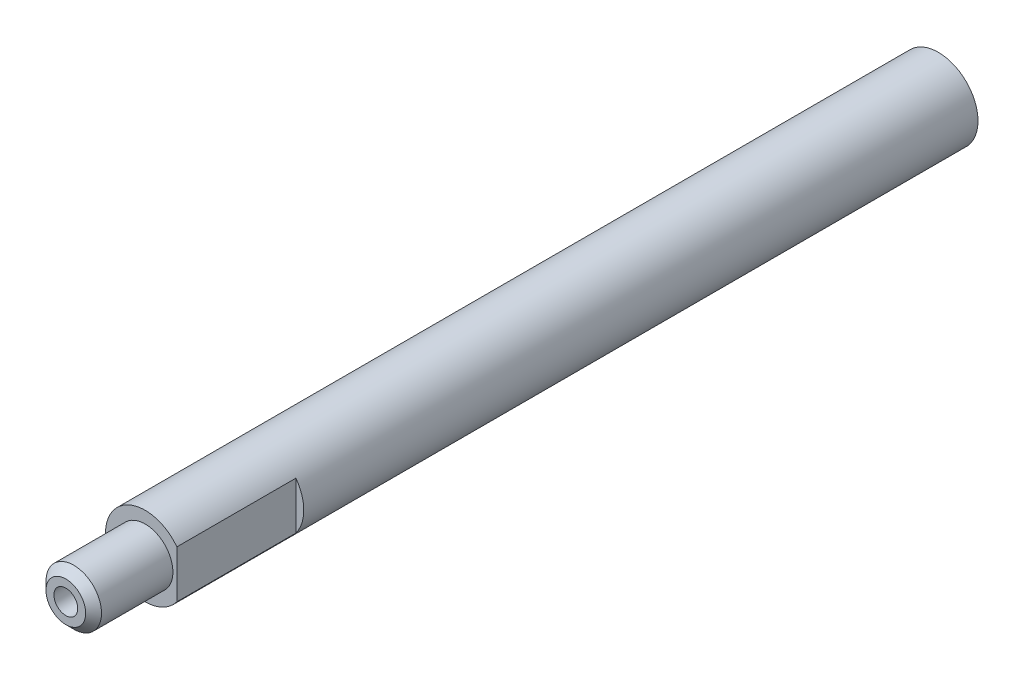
ISO-10303-21;
HEADER;
FILE_DESCRIPTION(('STEP AP214'),'2;1');
FILE_NAME('part.step','',(''),(''),'','','');
FILE_SCHEMA(('AUTOMOTIVE_DESIGN { 1 0 10303 214 1 1 1 1 }'));
ENDSEC;
DATA;
#1=APPLICATION_CONTEXT('core data for automotive mechanical design processes');
#2=APPLICATION_PROTOCOL_DEFINITION('international standard','automotive_design',2000,#1);
#3=PRODUCT_CONTEXT('',#1,'mechanical');
#4=PRODUCT('Part','Part','',(#3));
#5=PRODUCT_RELATED_PRODUCT_CATEGORY('part','',(#4));
#6=PRODUCT_DEFINITION_FORMATION('','',#4);
#7=PRODUCT_DEFINITION_CONTEXT('part definition',#1,'design');
#8=PRODUCT_DEFINITION('design','',#6,#7);
#9=PRODUCT_DEFINITION_SHAPE('','',#8);
#10=(LENGTH_UNIT() NAMED_UNIT(*) SI_UNIT(.MILLI.,.METRE.));
#11=(NAMED_UNIT(*) PLANE_ANGLE_UNIT() SI_UNIT($,.RADIAN.));
#12=(NAMED_UNIT(*) SI_UNIT($,.STERADIAN.) SOLID_ANGLE_UNIT());
#13=UNCERTAINTY_MEASURE_WITH_UNIT(LENGTH_MEASURE(1.E-05),#10,'distance_accuracy_value','');
#14=(GEOMETRIC_REPRESENTATION_CONTEXT(3) GLOBAL_UNCERTAINTY_ASSIGNED_CONTEXT((#13)) GLOBAL_UNIT_ASSIGNED_CONTEXT((#10,
#11,#12)) REPRESENTATION_CONTEXT('',''));
#15=CARTESIAN_POINT('',(0.,0.,0.));
#16=DIRECTION('',(0.,0.,1.));
#17=DIRECTION('',(1.,0.,0.));
#18=AXIS2_PLACEMENT_3D('',#15,#16,#17);
#19=CARTESIAN_POINT('',(0.,0.,110.));
#20=DIRECTION('',(0.,0.,-1.));
#21=DIRECTION('',(-1.,0.,0.));
#22=AXIS2_PLACEMENT_3D('',#19,#20,#21);
#23=CYLINDRICAL_SURFACE('',#22,5.);
#24=CARTESIAN_POINT('',(0.,0.,100.));
#25=DIRECTION('',(0.,0.,1.));
#26=DIRECTION('',(1.,0.,0.));
#27=AXIS2_PLACEMENT_3D('',#24,#25,#26);
#28=CIRCLE('',#27,5.);
#29=CARTESIAN_POINT('',(4.,3.,100.));
#30=VERTEX_POINT('',#29);
#31=CARTESIAN_POINT('',(4.,-3.,100.));
#32=VERTEX_POINT('',#31);
#33=EDGE_CURVE('E104',#30,#32,#28,.T.);
#34=ORIENTED_EDGE('',*,*,#33,.F.);
#35=DIRECTION('',(0.,0.,1.));
#36=VECTOR('',#35,1.);
#37=CARTESIAN_POINT('',(4.,3.,85.));
#38=LINE('',#37,#36);
#39=CARTESIAN_POINT('',(4.,3.,85.));
#40=VERTEX_POINT('',#39);
#41=EDGE_CURVE('E53',#40,#30,#38,.T.);
#42=ORIENTED_EDGE('',*,*,#41,.F.);
#43=CARTESIAN_POINT('',(0.,0.,85.));
#44=DIRECTION('',(0.,0.,1.));
#45=DIRECTION('',(1.,0.,0.));
#46=AXIS2_PLACEMENT_3D('',#43,#44,#45);
#47=CIRCLE('',#46,5.);
#48=CARTESIAN_POINT('',(4.,-3.,85.));
#49=VERTEX_POINT('',#48);
#50=EDGE_CURVE('E82',#49,#40,#47,.T.);
#51=ORIENTED_EDGE('',*,*,#50,.F.);
#52=DIRECTION('',(0.,0.,1.));
#53=VECTOR('',#52,1.);
#54=CARTESIAN_POINT('',(4.,-3.,85.));
#55=LINE('',#54,#53);
#56=EDGE_CURVE('E91',#49,#32,#55,.T.);
#57=ORIENTED_EDGE('',*,*,#56,.T.);
#58=EDGE_LOOP('',(#34,#42,#51,#57));
#59=FACE_BOUND('',#58,.T.);
#60=CARTESIAN_POINT('',(0.,0.,0.));
#61=DIRECTION('',(0.,0.,1.));
#62=DIRECTION('',(1.,0.,0.));
#63=AXIS2_PLACEMENT_3D('',#60,#61,#62);
#64=CIRCLE('',#63,5.);
#65=CARTESIAN_POINT('',(5.,0.,0.));
#66=VERTEX_POINT('',#65);
#67=EDGE_CURVE('E105',#66,#66,#64,.T.);
#68=ORIENTED_EDGE('',*,*,#67,.T.);
#69=EDGE_LOOP('',(#68));
#70=FACE_BOUND('',#69,.T.);
#71=ADVANCED_FACE('F38',(#59,#70),#23,.T.);
#72=CARTESIAN_POINT('',(0.,0.,0.));
#73=DIRECTION('',(0.,0.,1.));
#74=DIRECTION('',(1.,0.,0.));
#75=AXIS2_PLACEMENT_3D('',#72,#73,#74);
#76=PLANE('',#75);
#77=CARTESIAN_POINT('',(0.,0.,0.));
#78=DIRECTION('',(0.,0.,-1.));
#79=DIRECTION('',(-1.,0.,0.));
#80=AXIS2_PLACEMENT_3D('',#77,#78,#79);
#81=CIRCLE('',#80,2.);
#82=CARTESIAN_POINT('',(-2.,0.,0.));
#83=VERTEX_POINT('',#82);
#84=EDGE_CURVE('E80',#83,#83,#81,.T.);
#85=ORIENTED_EDGE('',*,*,#84,.F.);
#86=EDGE_LOOP('',(#85));
#87=FACE_BOUND('',#86,.T.);
#88=ORIENTED_EDGE('',*,*,#67,.F.);
#89=EDGE_LOOP('',(#88));
#90=FACE_BOUND('',#89,.T.);
#91=ADVANCED_FACE('F129',(#87,#90),#76,.F.);
#92=CARTESIAN_POINT('',(0.,0.,100.));
#93=DIRECTION('',(0.,0.,1.));
#94=DIRECTION('',(1.,0.,0.));
#95=AXIS2_PLACEMENT_3D('',#92,#93,#94);
#96=PLANE('',#95);
#97=DIRECTION('',(0.,-1.,0.));
#98=VECTOR('',#97,1.);
#99=CARTESIAN_POINT('',(4.,3.,100.));
#100=LINE('',#99,#98);
#101=EDGE_CURVE('E79',#30,#32,#100,.T.);
#102=ORIENTED_EDGE('',*,*,#101,.F.);
#103=ORIENTED_EDGE('',*,*,#33,.T.);
#104=EDGE_LOOP('',(#102,#103));
#105=FACE_BOUND('',#104,.T.);
#106=CARTESIAN_POINT('',(0.,0.,100.));
#107=DIRECTION('',(0.,0.,1.));
#108=DIRECTION('',(1.,0.,0.));
#109=AXIS2_PLACEMENT_3D('',#106,#107,#108);
#110=CIRCLE('',#109,3.5);
#111=CARTESIAN_POINT('',(3.5,0.,100.));
#112=VERTEX_POINT('',#111);
#113=EDGE_CURVE('E101',#112,#112,#110,.T.);
#114=ORIENTED_EDGE('',*,*,#113,.F.);
#115=EDGE_LOOP('',(#114));
#116=FACE_BOUND('',#115,.T.);
#117=ADVANCED_FACE('F134',(#105,#116),#96,.T.);
#118=CARTESIAN_POINT('',(0.,0.,100.));
#119=DIRECTION('',(0.,0.,1.));
#120=DIRECTION('',(1.,0.,0.));
#121=AXIS2_PLACEMENT_3D('',#118,#119,#120);
#122=CYLINDRICAL_SURFACE('',#121,3.5);
#123=CARTESIAN_POINT('',(0.,0.,109.));
#124=DIRECTION('',(0.,0.,1.));
#125=DIRECTION('',(1.,0.,0.));
#126=AXIS2_PLACEMENT_3D('',#123,#124,#125);
#127=CIRCLE('',#126,3.5);
#128=CARTESIAN_POINT('',(3.5,0.,109.));
#129=VERTEX_POINT('',#128);
#130=EDGE_CURVE('E12',#129,#129,#127,.F.);
#131=ORIENTED_EDGE('',*,*,#130,.T.);
#132=EDGE_LOOP('',(#131));
#133=FACE_BOUND('',#132,.T.);
#134=ORIENTED_EDGE('',*,*,#113,.T.);
#135=EDGE_LOOP('',(#134));
#136=FACE_BOUND('',#135,.T.);
#137=ADVANCED_FACE('F142',(#133,#136),#122,.T.);
#138=CARTESIAN_POINT('',(0.,0.,110.));
#139=DIRECTION('',(0.,0.,1.));
#140=DIRECTION('',(1.,0.,0.));
#141=AXIS2_PLACEMENT_3D('',#138,#139,#140);
#142=PLANE('',#141);
#143=CARTESIAN_POINT('',(0.,0.,110.));
#144=DIRECTION('',(0.,0.,1.));
#145=DIRECTION('',(1.,0.,0.));
#146=AXIS2_PLACEMENT_3D('',#143,#144,#145);
#147=CIRCLE('',#146,2.5);
#148=CARTESIAN_POINT('',(2.5,0.,110.));
#149=VERTEX_POINT('',#148);
#150=EDGE_CURVE('E46',#149,#149,#147,.T.);
#151=ORIENTED_EDGE('',*,*,#150,.T.);
#152=EDGE_LOOP('',(#151));
#153=FACE_BOUND('',#152,.T.);
#154=CARTESIAN_POINT('',(0.,0.,110.));
#155=DIRECTION('',(0.,0.,1.));
#156=DIRECTION('',(1.,0.,0.));
#157=AXIS2_PLACEMENT_3D('',#154,#155,#156);
#158=CIRCLE('',#157,1.49999999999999);
#159=CARTESIAN_POINT('',(1.49999999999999,0.,110.));
#160=VERTEX_POINT('',#159);
#161=EDGE_CURVE('E94',#160,#160,#158,.T.);
#162=ORIENTED_EDGE('',*,*,#161,.F.);
#163=EDGE_LOOP('',(#162));
#164=FACE_BOUND('',#163,.T.);
#165=ADVANCED_FACE('F112',(#153,#164),#142,.T.);
#166=CARTESIAN_POINT('',(0.,0.,100.));
#167=DIRECTION('',(0.,0.,1.));
#168=DIRECTION('',(1.,0.,0.));
#169=AXIS2_PLACEMENT_3D('',#166,#167,#168);
#170=CONICAL_SURFACE('',#169,1.5,1.02974425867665);
#171=CARTESIAN_POINT('',(0.,0.,99.0987090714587));
#172=VERTEX_POINT('',#171);
#173=VERTEX_LOOP('',#172);
#174=FACE_BOUND('',#173,.T.);
#175=CARTESIAN_POINT('',(0.,0.,100.));
#176=DIRECTION('',(0.,0.,1.));
#177=DIRECTION('',(1.,0.,0.));
#178=AXIS2_PLACEMENT_3D('',#175,#176,#177);
#179=CIRCLE('',#178,1.5);
#180=CARTESIAN_POINT('',(1.5,0.,100.));
#181=VERTEX_POINT('',#180);
#182=EDGE_CURVE('E98',#181,#181,#179,.T.);
#183=ORIENTED_EDGE('',*,*,#182,.T.);
#184=EDGE_LOOP('',(#183));
#185=FACE_BOUND('',#184,.T.);
#186=ADVANCED_FACE('F124',(#174,#185),#170,.F.);
#187=CARTESIAN_POINT('',(0.,0.,110.));
#188=DIRECTION('',(0.,0.,1.));
#189=DIRECTION('',(1.,0.,0.));
#190=AXIS2_PLACEMENT_3D('',#187,#188,#189);
#191=CYLINDRICAL_SURFACE('',#190,1.49999999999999);
#192=ORIENTED_EDGE('',*,*,#182,.F.);
#193=EDGE_LOOP('',(#192));
#194=FACE_BOUND('',#193,.T.);
#195=ORIENTED_EDGE('',*,*,#161,.T.);
#196=EDGE_LOOP('',(#195));
#197=FACE_BOUND('',#196,.T.);
#198=ADVANCED_FACE('F117',(#194,#197),#191,.F.);
#199=CARTESIAN_POINT('',(0.,0.,110.));
#200=DIRECTION('',(0.,0.,-1.));
#201=DIRECTION('',(-1.,0.,0.));
#202=AXIS2_PLACEMENT_3D('',#199,#200,#201);
#203=CONICAL_SURFACE('',#202,2.5,0.785398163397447);
#204=ORIENTED_EDGE('',*,*,#130,.F.);
#205=EDGE_LOOP('',(#204));
#206=FACE_BOUND('',#205,.T.);
#207=ORIENTED_EDGE('',*,*,#150,.F.);
#208=EDGE_LOOP('',(#207));
#209=FACE_BOUND('',#208,.T.);
#210=ADVANCED_FACE('F40',(#206,#209),#203,.T.);
#211=CARTESIAN_POINT('',(4.,3.,85.));
#212=DIRECTION('',(-1.,0.,0.));
#213=DIRECTION('',(0.,0.,1.));
#214=AXIS2_PLACEMENT_3D('',#211,#212,#213);
#215=PLANE('',#214);
#216=ORIENTED_EDGE('',*,*,#101,.T.);
#217=ORIENTED_EDGE('',*,*,#56,.F.);
#218=DIRECTION('',(0.,-1.,0.));
#219=VECTOR('',#218,1.);
#220=CARTESIAN_POINT('',(4.,3.,85.));
#221=LINE('',#220,#219);
#222=EDGE_CURVE('E88',#40,#49,#221,.T.);
#223=ORIENTED_EDGE('',*,*,#222,.F.);
#224=ORIENTED_EDGE('',*,*,#41,.T.);
#225=EDGE_LOOP('',(#216,#217,#223,#224));
#226=FACE_BOUND('',#225,.T.);
#227=ADVANCED_FACE('F116',(#226),#215,.F.);
#228=CARTESIAN_POINT('',(0.,0.,85.));
#229=DIRECTION('',(0.,0.,1.));
#230=DIRECTION('',(1.,0.,0.));
#231=AXIS2_PLACEMENT_3D('',#228,#229,#230);
#232=PLANE('',#231);
#233=ORIENTED_EDGE('',*,*,#50,.T.);
#234=ORIENTED_EDGE('',*,*,#222,.T.);
#235=EDGE_LOOP('',(#233,#234));
#236=FACE_BOUND('',#235,.T.);
#237=ADVANCED_FACE('F73',(#236),#232,.T.);
#238=CARTESIAN_POINT('',(0.,0.,20.));
#239=DIRECTION('',(0.,0.,-1.));
#240=DIRECTION('',(-1.,0.,0.));
#241=AXIS2_PLACEMENT_3D('',#238,#239,#240);
#242=CONICAL_SURFACE('',#241,2.,1.02974425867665);
#243=CARTESIAN_POINT('',(0.,0.,21.2017212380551));
#244=VERTEX_POINT('',#243);
#245=VERTEX_LOOP('',#244);
#246=FACE_BOUND('',#245,.T.);
#247=CARTESIAN_POINT('',(0.,0.,20.));
#248=DIRECTION('',(0.,0.,-1.));
#249=DIRECTION('',(-1.,0.,0.));
#250=AXIS2_PLACEMENT_3D('',#247,#248,#249);
#251=CIRCLE('',#250,2.);
#252=CARTESIAN_POINT('',(-2.,0.,20.));
#253=VERTEX_POINT('',#252);
#254=EDGE_CURVE('E77',#253,#253,#251,.T.);
#255=ORIENTED_EDGE('',*,*,#254,.T.);
#256=EDGE_LOOP('',(#255));
#257=FACE_BOUND('',#256,.T.);
#258=ADVANCED_FACE('F69',(#246,#257),#242,.F.);
#259=CARTESIAN_POINT('',(0.,0.,0.));
#260=DIRECTION('',(0.,0.,-1.));
#261=DIRECTION('',(-1.,0.,0.));
#262=AXIS2_PLACEMENT_3D('',#259,#260,#261);
#263=CYLINDRICAL_SURFACE('',#262,2.);
#264=ORIENTED_EDGE('',*,*,#254,.F.);
#265=EDGE_LOOP('',(#264));
#266=FACE_BOUND('',#265,.T.);
#267=ORIENTED_EDGE('',*,*,#84,.T.);
#268=EDGE_LOOP('',(#267));
#269=FACE_BOUND('',#268,.T.);
#270=ADVANCED_FACE('F72',(#266,#269),#263,.F.);
#271=CLOSED_SHELL('',(#71,#91,#117,#137,#165,#186,#198,#210,#227,#237,#258,#270));
#272=MANIFOLD_SOLID_BREP('B2',#271);
#273=ADVANCED_BREP_SHAPE_REPRESENTATION('',(#18,#272),#14);
#274=SHAPE_DEFINITION_REPRESENTATION(#9,#273);
ENDSEC;
END-ISO-10303-21;
